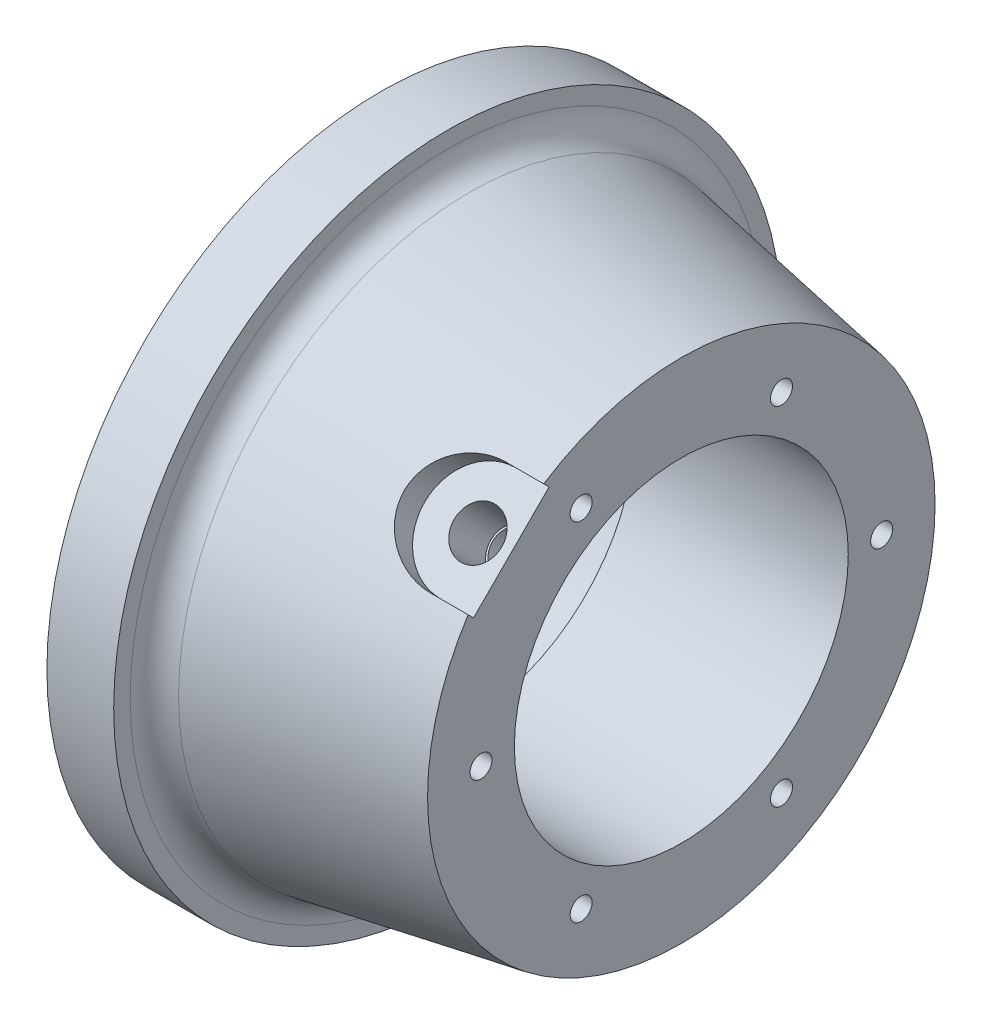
ISO-10303-21;
HEADER;
FILE_DESCRIPTION(('STEP AP214'),'2;1');
FILE_NAME('part.step','',(''),(''),'','','');
FILE_SCHEMA(('AUTOMOTIVE_DESIGN { 1 0 10303 214 1 1 1 1 }'));
ENDSEC;
DATA;
#1=APPLICATION_CONTEXT('core data for automotive mechanical design processes');
#2=APPLICATION_PROTOCOL_DEFINITION('international standard','automotive_design',2000,#1);
#3=PRODUCT_CONTEXT('',#1,'mechanical');
#4=PRODUCT('Part','Part','',(#3));
#5=PRODUCT_RELATED_PRODUCT_CATEGORY('part','',(#4));
#6=PRODUCT_DEFINITION_FORMATION('','',#4);
#7=PRODUCT_DEFINITION_CONTEXT('part definition',#1,'design');
#8=PRODUCT_DEFINITION('design','',#6,#7);
#9=PRODUCT_DEFINITION_SHAPE('','',#8);
#10=(LENGTH_UNIT() NAMED_UNIT(*) SI_UNIT(.MILLI.,.METRE.));
#11=(NAMED_UNIT(*) PLANE_ANGLE_UNIT() SI_UNIT($,.RADIAN.));
#12=(NAMED_UNIT(*) SI_UNIT($,.STERADIAN.) SOLID_ANGLE_UNIT());
#13=UNCERTAINTY_MEASURE_WITH_UNIT(LENGTH_MEASURE(1.E-05),#10,'distance_accuracy_value','');
#14=(GEOMETRIC_REPRESENTATION_CONTEXT(3) GLOBAL_UNCERTAINTY_ASSIGNED_CONTEXT((#13)) GLOBAL_UNIT_ASSIGNED_CONTEXT((#10,
#11,#12)) REPRESENTATION_CONTEXT('',''));
#15=CARTESIAN_POINT('',(0.,0.,0.));
#16=DIRECTION('',(0.,0.,1.));
#17=DIRECTION('',(1.,0.,0.));
#18=AXIS2_PLACEMENT_3D('',#15,#16,#17);
#19=CARTESIAN_POINT('',(9.5,0.,0.));
#20=DIRECTION('',(-1.,0.,0.));
#21=DIRECTION('',(0.,0.,1.));
#22=AXIS2_PLACEMENT_3D('',#19,#20,#21);
#23=PLANE('',#22);
#24=CARTESIAN_POINT('',(9.5,0.,0.));
#25=DIRECTION('',(-1.,0.,0.));
#26=DIRECTION('',(0.,0.,1.));
#27=AXIS2_PLACEMENT_3D('',#24,#25,#26);
#28=CIRCLE('',#27,8.74999999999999);
#29=CARTESIAN_POINT('',(9.5,0.,8.74999999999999));
#30=VERTEX_POINT('',#29);
#31=EDGE_CURVE('E142',#30,#30,#28,.T.);
#32=ORIENTED_EDGE('',*,*,#31,.T.);
#33=EDGE_LOOP('',(#32));
#34=FACE_BOUND('',#33,.T.);
#35=CARTESIAN_POINT('',(9.5,0.,0.));
#36=DIRECTION('',(-1.,0.,0.));
#37=DIRECTION('',(0.,0.,1.));
#38=AXIS2_PLACEMENT_3D('',#35,#36,#37);
#39=CIRCLE('',#38,13.);
#40=CARTESIAN_POINT('',(9.5,0.,13.));
#41=VERTEX_POINT('',#40);
#42=EDGE_CURVE('E210',#41,#41,#39,.T.);
#43=ORIENTED_EDGE('',*,*,#42,.F.);
#44=EDGE_LOOP('',(#43));
#45=FACE_BOUND('',#44,.T.);
#46=ADVANCED_FACE('F43',(#34,#45),#23,.F.);
#47=CARTESIAN_POINT('',(0.,0.,0.));
#48=DIRECTION('',(-1.,0.,0.));
#49=DIRECTION('',(0.,0.,1.));
#50=AXIS2_PLACEMENT_3D('',#47,#48,#49);
#51=CYLINDRICAL_SURFACE('',#50,13.);
#52=CARTESIAN_POINT('',(7.5,0.,0.));
#53=DIRECTION('',(-1.,0.,0.));
#54=DIRECTION('',(0.,0.,1.));
#55=AXIS2_PLACEMENT_3D('',#52,#53,#54);
#56=CIRCLE('',#55,13.);
#57=CARTESIAN_POINT('',(7.5,0.,13.));
#58=VERTEX_POINT('',#57);
#59=EDGE_CURVE('E207',#58,#58,#56,.T.);
#60=ORIENTED_EDGE('',*,*,#59,.F.);
#61=EDGE_LOOP('',(#60));
#62=FACE_BOUND('',#61,.T.);
#63=ORIENTED_EDGE('',*,*,#42,.T.);
#64=EDGE_LOOP('',(#63));
#65=FACE_BOUND('',#64,.T.);
#66=ADVANCED_FACE('F305',(#62,#65),#51,.T.);
#67=CARTESIAN_POINT('',(7.5,13.,0.));
#68=DIRECTION('',(-1.,0.,0.));
#69=DIRECTION('',(0.,0.,1.));
#70=AXIS2_PLACEMENT_3D('',#67,#68,#69);
#71=PLANE('',#70);
#72=CARTESIAN_POINT('',(7.5,18.,0.));
#73=DIRECTION('',(1.,0.,0.));
#74=DIRECTION('',(0.,0.,-1.));
#75=AXIS2_PLACEMENT_3D('',#72,#73,#74);
#76=CIRCLE('',#75,0.999999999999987);
#77=CARTESIAN_POINT('',(7.5,18.,-0.999999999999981));
#78=VERTEX_POINT('',#77);
#79=EDGE_CURVE('E562',#78,#78,#76,.T.);
#80=ORIENTED_EDGE('',*,*,#79,.F.);
#81=EDGE_LOOP('',(#80));
#82=FACE_BOUND('',#81,.T.);
#83=CARTESIAN_POINT('',(7.5,0.,0.));
#84=DIRECTION('',(-1.,0.,0.));
#85=DIRECTION('',(0.,0.,1.));
#86=AXIS2_PLACEMENT_3D('',#83,#84,#85);
#87=CIRCLE('',#86,28.);
#88=CARTESIAN_POINT('',(7.5,0.,28.));
#89=VERTEX_POINT('',#88);
#90=EDGE_CURVE('E202',#89,#89,#87,.T.);
#91=ORIENTED_EDGE('',*,*,#90,.F.);
#92=EDGE_LOOP('',(#91));
#93=FACE_BOUND('',#92,.T.);
#94=ORIENTED_EDGE('',*,*,#59,.T.);
#95=EDGE_LOOP('',(#94));
#96=FACE_BOUND('',#95,.T.);
#97=ADVANCED_FACE('F310',(#82,#93,#96),#71,.F.);
#98=CARTESIAN_POINT('',(0.,0.,0.));
#99=DIRECTION('',(-1.,0.,0.));
#100=DIRECTION('',(0.,0.,1.));
#101=AXIS2_PLACEMENT_3D('',#98,#99,#100);
#102=CYLINDRICAL_SURFACE('',#101,28.);
#103=CARTESIAN_POINT('',(13.,0.,0.));
#104=DIRECTION('',(-1.,0.,0.));
#105=DIRECTION('',(0.,0.,1.));
#106=AXIS2_PLACEMENT_3D('',#103,#104,#105);
#107=CIRCLE('',#106,28.);
#108=CARTESIAN_POINT('',(13.,0.,28.));
#109=VERTEX_POINT('',#108);
#110=EDGE_CURVE('E200',#109,#109,#107,.T.);
#111=ORIENTED_EDGE('',*,*,#110,.F.);
#112=EDGE_LOOP('',(#111));
#113=FACE_BOUND('',#112,.T.);
#114=ORIENTED_EDGE('',*,*,#90,.T.);
#115=EDGE_LOOP('',(#114));
#116=FACE_BOUND('',#115,.T.);
#117=ADVANCED_FACE('F320',(#113,#116),#102,.F.);
#118=CARTESIAN_POINT('',(13.,25.,0.));
#119=DIRECTION('',(1.,0.,0.));
#120=DIRECTION('',(0.,0.,-1.));
#121=AXIS2_PLACEMENT_3D('',#118,#119,#120);
#122=PLANE('',#121);
#123=CARTESIAN_POINT('',(13.,0.,0.));
#124=DIRECTION('',(-1.,0.,0.));
#125=DIRECTION('',(0.,0.,1.));
#126=AXIS2_PLACEMENT_3D('',#123,#124,#125);
#127=CIRCLE('',#126,25.);
#128=CARTESIAN_POINT('',(13.,0.,25.));
#129=VERTEX_POINT('',#128);
#130=EDGE_CURVE('E197',#129,#129,#127,.T.);
#131=ORIENTED_EDGE('',*,*,#130,.F.);
#132=EDGE_LOOP('',(#131));
#133=FACE_BOUND('',#132,.T.);
#134=ORIENTED_EDGE('',*,*,#110,.T.);
#135=EDGE_LOOP('',(#134));
#136=FACE_BOUND('',#135,.T.);
#137=ADVANCED_FACE('F327',(#133,#136),#122,.F.);
#138=CARTESIAN_POINT('',(0.,0.,0.));
#139=DIRECTION('',(-1.,0.,0.));
#140=DIRECTION('',(0.,0.,1.));
#141=AXIS2_PLACEMENT_3D('',#138,#139,#140);
#142=CYLINDRICAL_SURFACE('',#141,25.);
#143=CARTESIAN_POINT('',(40.,16.206796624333,19.0352237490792));
#144=CARTESIAN_POINT('',(39.8878521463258,16.2068008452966,19.035221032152));
#145=CARTESIAN_POINT('',(39.7756275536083,16.2140301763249,19.0290723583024));
#146=CARTESIAN_POINT('',(39.5542823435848,16.242718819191,19.004589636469));
#147=CARTESIAN_POINT('',(39.4451654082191,16.2641943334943,18.9862417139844));
#148=CARTESIAN_POINT('',(39.233273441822,16.3206182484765,18.9377610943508));
#149=CARTESIAN_POINT('',(39.1304948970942,16.3555591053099,18.9076349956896));
#150=CARTESIAN_POINT('',(38.9341442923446,16.4377059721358,18.8362620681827));
#151=CARTESIAN_POINT('',(38.8405702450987,16.4849093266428,18.7950176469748));
#152=CARTESIAN_POINT('',(38.6650375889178,16.5901118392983,18.7022219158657));
#153=CARTESIAN_POINT('',(38.5831038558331,16.6481335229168,18.6506490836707));
#154=CARTESIAN_POINT('',(38.4333912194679,16.7730028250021,18.5384305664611));
#155=CARTESIAN_POINT('',(38.365612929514,16.8398508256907,18.4777844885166));
#156=CARTESIAN_POINT('',(38.2460532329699,16.9803226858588,18.3487801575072));
#157=CARTESIAN_POINT('',(38.1942932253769,17.0539554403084,18.2804117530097));
#158=CARTESIAN_POINT('',(38.1083762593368,17.2056129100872,18.1377427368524));
#159=CARTESIAN_POINT('',(38.0742190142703,17.2836375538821,18.0634422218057));
#160=CARTESIAN_POINT('',(38.0245484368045,17.4415291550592,17.91103202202));
#161=CARTESIAN_POINT('',(38.0089950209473,17.5213917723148,17.8329309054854));
#162=CARTESIAN_POINT('',(37.9968497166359,17.6807709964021,17.674923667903));
#163=CARTESIAN_POINT('',(38.0002575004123,17.7602876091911,17.5950175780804));
#164=CARTESIAN_POINT('',(38.0259050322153,17.916543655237,17.4358789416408));
#165=CARTESIAN_POINT('',(38.0481016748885,17.9932890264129,17.3566452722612));
#166=CARTESIAN_POINT('',(38.1106298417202,18.1421257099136,17.2010138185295));
#167=CARTESIAN_POINT('',(38.1509615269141,18.2142169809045,17.1246160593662));
#168=CARTESIAN_POINT('',(38.2486630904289,18.3519732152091,16.9769049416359));
#169=CARTESIAN_POINT('',(38.3060523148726,18.417630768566,16.9055974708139));
#170=CARTESIAN_POINT('',(38.4362258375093,18.540820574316,16.770401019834));
#171=CARTESIAN_POINT('',(38.5090104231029,18.5983526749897,16.7065121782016));
#172=CARTESIAN_POINT('',(38.6681516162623,18.7040931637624,16.5880449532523));
#173=CARTESIAN_POINT('',(38.7545456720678,18.7522749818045,16.5334931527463));
#174=CARTESIAN_POINT('',(38.9383227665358,18.8380194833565,16.4357313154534));
#175=CARTESIAN_POINT('',(39.0357058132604,18.8755821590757,16.3925212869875));
#176=CARTESIAN_POINT('',(39.2387224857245,18.9392599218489,16.3189097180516));
#177=CARTESIAN_POINT('',(39.3443570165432,18.9653737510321,16.2885095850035));
#178=CARTESIAN_POINT('',(39.5608657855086,19.0055763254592,16.2415834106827));
#179=CARTESIAN_POINT('',(39.6717399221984,19.0196653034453,16.2250571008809));
#180=CARTESIAN_POINT('',(39.8952518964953,19.0354909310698,16.2064874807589));
#181=CARTESIAN_POINT('',(40.0078839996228,19.0372616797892,16.204404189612));
#182=CARTESIAN_POINT('',(40.2320034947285,19.0285030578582,16.2146882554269));
#183=CARTESIAN_POINT('',(40.3434908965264,19.0179737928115,16.2270554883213));
#184=CARTESIAN_POINT('',(40.5620062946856,18.9848647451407,16.2657785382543));
#185=CARTESIAN_POINT('',(40.6690399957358,18.9623009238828,16.2921158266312));
#186=CARTESIAN_POINT('',(40.8757862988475,18.9056206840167,16.3578537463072));
#187=CARTESIAN_POINT('',(40.9754987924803,18.8715040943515,16.3972545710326));
#188=CARTESIAN_POINT('',(41.165012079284,18.7923772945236,16.4878794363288));
#189=CARTESIAN_POINT('',(41.2547906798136,18.7473433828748,16.5391291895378));
#190=CARTESIAN_POINT('',(41.4216635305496,18.6474306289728,16.6516959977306));
#191=CARTESIAN_POINT('',(41.4987575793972,18.5925516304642,16.7130132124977));
#192=CARTESIAN_POINT('',(41.6382513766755,18.4740839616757,16.8438717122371));
#193=CARTESIAN_POINT('',(41.7006171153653,18.410475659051,16.9134314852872));
#194=CARTESIAN_POINT('',(41.8086507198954,18.276191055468,17.0584463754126));
#195=CARTESIAN_POINT('',(41.854318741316,18.2055148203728,17.1339014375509));
#196=CARTESIAN_POINT('',(41.9276020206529,18.0589831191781,17.2882743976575));
#197=CARTESIAN_POINT('',(41.9552383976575,17.983133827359,17.367188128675));
#198=CARTESIAN_POINT('',(41.9917429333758,17.8282129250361,17.5261843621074));
#199=CARTESIAN_POINT('',(42.0006114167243,17.749141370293,17.6062668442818));
#200=CARTESIAN_POINT('',(41.9993247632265,17.5902151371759,17.765047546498));
#201=CARTESIAN_POINT('',(41.9892226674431,17.5103632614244,17.8437490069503));
#202=CARTESIAN_POINT('',(41.9503921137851,17.3519757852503,17.9978094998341));
#203=CARTESIAN_POINT('',(41.9216636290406,17.2734401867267,18.0731685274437));
#204=CARTESIAN_POINT('',(41.8464090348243,17.1200448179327,18.218541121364));
#205=CARTESIAN_POINT('',(41.7998837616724,17.0451848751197,18.2885549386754));
#206=CARTESIAN_POINT('',(41.6903624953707,16.9014468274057,18.4214736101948));
#207=CARTESIAN_POINT('',(41.6273667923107,16.8325686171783,18.4843785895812));
#208=CARTESIAN_POINT('',(41.4864939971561,16.7027980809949,18.6017263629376));
#209=CARTESIAN_POINT('',(41.4085777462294,16.6419274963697,18.6561461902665));
#210=CARTESIAN_POINT('',(41.2401443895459,16.5303601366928,18.7550731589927));
#211=CARTESIAN_POINT('',(41.1496242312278,16.4796658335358,18.7995778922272));
#212=CARTESIAN_POINT('',(40.958390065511,16.3900876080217,18.877727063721));
#213=CARTESIAN_POINT('',(40.857658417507,16.3512246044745,18.9113522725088));
#214=CARTESIAN_POINT('',(40.6490585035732,16.2868006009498,18.9668645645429));
#215=CARTESIAN_POINT('',(40.5411986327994,16.2612242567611,18.9887651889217));
#216=CARTESIAN_POINT('',(40.3605817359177,16.2307980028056,19.0147686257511));
#217=CARTESIAN_POINT('',(40.2889874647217,16.2218115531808,19.0224313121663));
#218=CARTESIAN_POINT('',(40.144939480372,16.2098095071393,19.0326597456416));
#219=CARTESIAN_POINT('',(40.0724857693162,16.2067938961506,19.035225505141));
#220=CARTESIAN_POINT('',(40.,16.206796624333,19.0352237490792));
#221=B_SPLINE_CURVE_WITH_KNOTS('',3,(#143,#144,#145,#146,#147,#148,#149,#150,#151,#152,#153,
#154,#155,#156,#157,#158,#159,#160,#161,#162,#163,#164,#165,#166,#167,#168,#169,#170,#171,#172,
#173,#174,#175,#176,#177,#178,#179,#180,#181,#182,#183,#184,#185,#186,#187,#188,#189,#190,#191,
#192,#193,#194,#195,#196,#197,#198,#199,#200,#201,#202,#203,#204,#205,#206,#207,#208,#209,#210,
#211,#212,#213,#214,#215,#216,#217,#218,#219,#220),.UNSPECIFIED.,.T.,.F.,(4,2,2,2,2,2,2,2,2,2,2,
2,2,2,2,2,2,2,2,2,2,2,2,2,2,2,2,2,2,2,2,2,2,2,2,2,2,2,4),(0.,0.336178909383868,
0.672740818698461,1.00911444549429,1.34541529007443,1.68242434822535,2.01944800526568,
2.35691997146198,2.69438644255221,3.03112449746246,3.36785673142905,3.70381852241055,
4.03978329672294,4.37613057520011,4.71248413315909,5.04977992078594,5.38707595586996,
5.72440903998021,6.06173559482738,6.3981279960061,6.7345175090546,7.07046197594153,
7.40641141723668,7.74309684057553,8.07978760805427,8.41724840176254,8.75470605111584,
9.09176774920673,9.42882361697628,9.76493849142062,10.1010538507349,10.4371534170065,
10.7732470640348,11.1102351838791,11.4473050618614,11.7849674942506,12.122239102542,
12.339525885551,12.5568121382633),.UNSPECIFIED.);
#222=CARTESIAN_POINT('',(40.,16.206796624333,19.0352237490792));
#223=VERTEX_POINT('',#222);
#224=EDGE_CURVE('E555',#223,#223,#221,.T.);
#225=ORIENTED_EDGE('',*,*,#224,.F.);
#226=EDGE_LOOP('',(#225));
#227=FACE_BOUND('',#226,.T.);
#228=CARTESIAN_POINT('',(45.,0.,0.));
#229=DIRECTION('',(-1.,0.,0.));
#230=DIRECTION('',(0.,0.,1.));
#231=AXIS2_PLACEMENT_3D('',#228,#229,#230);
#232=CIRCLE('',#231,25.);
#233=CARTESIAN_POINT('',(45.,0.,25.));
#234=VERTEX_POINT('',#233);
#235=EDGE_CURVE('E194',#234,#234,#232,.T.);
#236=ORIENTED_EDGE('',*,*,#235,.F.);
#237=EDGE_LOOP('',(#236));
#238=FACE_BOUND('',#237,.T.);
#239=ORIENTED_EDGE('',*,*,#130,.T.);
#240=EDGE_LOOP('',(#239));
#241=FACE_BOUND('',#240,.T.);
#242=ADVANCED_FACE('F331',(#227,#238,#241),#142,.F.);
#243=CARTESIAN_POINT('',(45.,38.,0.));
#244=DIRECTION('',(-1.,0.,0.));
#245=DIRECTION('',(0.,0.,1.));
#246=AXIS2_PLACEMENT_3D('',#243,#244,#245);
#247=PLANE('',#246);
#248=CARTESIAN_POINT('',(45.,0.,0.));
#249=DIRECTION('',(-1.,0.,0.));
#250=DIRECTION('',(0.,0.,1.));
#251=AXIS2_PLACEMENT_3D('',#248,#249,#250);
#252=CIRCLE('',#251,38.);
#253=CARTESIAN_POINT('',(45.,31.9247053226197,20.6109968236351));
#254=VERTEX_POINT('',#253);
#255=CARTESIAN_POINT('',(45.,20.610996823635,31.9247053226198));
#256=VERTEX_POINT('',#255);
#257=EDGE_CURVE('E192',#254,#256,#252,.T.);
#258=ORIENTED_EDGE('',*,*,#257,.F.);
#259=DIRECTION('',(0.,-0.707106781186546,-0.707106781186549));
#260=VECTOR('',#259,1.);
#261=CARTESIAN_POINT('',(45.,55.6568542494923,44.3431457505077));
#262=LINE('',#261,#260);
#263=CARTESIAN_POINT('',(45.,31.1126983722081,19.7989898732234));
#264=VERTEX_POINT('',#263);
#265=EDGE_CURVE('E125',#254,#264,#262,.T.);
#266=ORIENTED_EDGE('',*,*,#265,.T.);
#267=DIRECTION('',(0.,-0.707106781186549,0.707106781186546));
#268=VECTOR('',#267,1.);
#269=CARTESIAN_POINT('',(45.,19.7989898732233,31.1126983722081));
#270=LINE('',#269,#268);
#271=CARTESIAN_POINT('',(45.,19.7989898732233,31.1126983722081));
#272=VERTEX_POINT('',#271);
#273=EDGE_CURVE('E117',#264,#272,#270,.T.);
#274=ORIENTED_EDGE('',*,*,#273,.T.);
#275=DIRECTION('',(0.,-0.707106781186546,-0.707106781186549));
#276=VECTOR('',#275,1.);
#277=CARTESIAN_POINT('',(45.,44.3431457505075,55.6568542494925));
#278=LINE('',#277,#276);
#279=EDGE_CURVE('E101',#256,#272,#278,.T.);
#280=ORIENTED_EDGE('',*,*,#279,.F.);
#281=EDGE_LOOP('',(#258,#266,#274,#280));
#282=FACE_BOUND('',#281,.T.);
#283=CARTESIAN_POINT('',(45.,-25.980762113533,-15.0000000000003));
#284=DIRECTION('',(1.,0.,0.));
#285=DIRECTION('',(0.,0.,-1.));
#286=AXIS2_PLACEMENT_3D('',#283,#284,#285);
#287=CIRCLE('',#286,1.65);
#288=CARTESIAN_POINT('',(45.,-25.980762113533,-16.6500000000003));
#289=VERTEX_POINT('',#288);
#290=EDGE_CURVE('E146',#289,#289,#287,.T.);
#291=ORIENTED_EDGE('',*,*,#290,.F.);
#292=EDGE_LOOP('',(#291));
#293=FACE_BOUND('',#292,.T.);
#294=CARTESIAN_POINT('',(45.,-25.9807621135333,14.9999999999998));
#295=DIRECTION('',(1.,0.,0.));
#296=DIRECTION('',(0.,0.,-1.));
#297=AXIS2_PLACEMENT_3D('',#294,#295,#296);
#298=CIRCLE('',#297,1.65);
#299=CARTESIAN_POINT('',(45.,-25.9807621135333,13.3499999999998));
#300=VERTEX_POINT('',#299);
#301=EDGE_CURVE('E152',#300,#300,#298,.T.);
#302=ORIENTED_EDGE('',*,*,#301,.F.);
#303=EDGE_LOOP('',(#302));
#304=FACE_BOUND('',#303,.T.);
#305=CARTESIAN_POINT('',(45.,-2.09489001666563E-13,30.));
#306=DIRECTION('',(1.,0.,0.));
#307=DIRECTION('',(0.,0.,-1.));
#308=AXIS2_PLACEMENT_3D('',#305,#306,#307);
#309=CIRCLE('',#308,1.65);
#310=CARTESIAN_POINT('',(45.,-2.09489001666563E-13,28.35));
#311=VERTEX_POINT('',#310);
#312=EDGE_CURVE('E158',#311,#311,#309,.T.);
#313=ORIENTED_EDGE('',*,*,#312,.F.);
#314=EDGE_LOOP('',(#313));
#315=FACE_BOUND('',#314,.T.);
#316=CARTESIAN_POINT('',(45.,25.9807621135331,15.0000000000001));
#317=DIRECTION('',(1.,0.,0.));
#318=DIRECTION('',(0.,0.,-1.));
#319=AXIS2_PLACEMENT_3D('',#316,#317,#318);
#320=CIRCLE('',#319,1.65);
#321=CARTESIAN_POINT('',(45.,25.9807621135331,13.3500000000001));
#322=VERTEX_POINT('',#321);
#323=EDGE_CURVE('E164',#322,#322,#320,.T.);
#324=ORIENTED_EDGE('',*,*,#323,.F.);
#325=EDGE_LOOP('',(#324));
#326=FACE_BOUND('',#325,.T.);
#327=CARTESIAN_POINT('',(45.,25.9807621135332,-14.9999999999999));
#328=DIRECTION('',(1.,0.,0.));
#329=DIRECTION('',(0.,0.,-1.));
#330=AXIS2_PLACEMENT_3D('',#327,#328,#329);
#331=CIRCLE('',#330,1.65);
#332=CARTESIAN_POINT('',(45.,25.9807621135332,-16.6499999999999));
#333=VERTEX_POINT('',#332);
#334=EDGE_CURVE('E170',#333,#333,#331,.T.);
#335=ORIENTED_EDGE('',*,*,#334,.F.);
#336=EDGE_LOOP('',(#335));
#337=FACE_BOUND('',#336,.T.);
#338=CARTESIAN_POINT('',(45.,0.,-30.));
#339=DIRECTION('',(1.,0.,0.));
#340=DIRECTION('',(0.,0.,-1.));
#341=AXIS2_PLACEMENT_3D('',#338,#339,#340);
#342=CIRCLE('',#341,1.65);
#343=CARTESIAN_POINT('',(45.,0.,-31.65));
#344=VERTEX_POINT('',#343);
#345=EDGE_CURVE('E176',#344,#344,#342,.T.);
#346=ORIENTED_EDGE('',*,*,#345,.F.);
#347=EDGE_LOOP('',(#346));
#348=FACE_BOUND('',#347,.T.);
#349=ORIENTED_EDGE('',*,*,#235,.T.);
#350=EDGE_LOOP('',(#349));
#351=FACE_BOUND('',#350,.T.);
#352=ADVANCED_FACE('F123',(#282,#293,#304,#315,#326,#337,#348,#351),#247,.F.);
#353=CARTESIAN_POINT('',(45.,0.,0.));
#354=DIRECTION('',(-1.,0.,0.));
#355=DIRECTION('',(0.,0.,1.));
#356=AXIS2_PLACEMENT_3D('',#353,#354,#355);
#357=CONICAL_SURFACE('',#356,38.,0.17453292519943);
#358=CARTESIAN_POINT('',(13.3054072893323,0.,0.));
#359=DIRECTION('',(-1.,0.,0.));
#360=DIRECTION('',(0.,0.,1.));
#361=AXIS2_PLACEMENT_3D('',#358,#359,#360);
#362=CIRCLE('',#361,43.5886118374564);
#363=CARTESIAN_POINT('',(13.3054072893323,0.,43.5886118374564));
#364=VERTEX_POINT('',#363);
#365=EDGE_CURVE('E188',#364,#364,#362,.T.);
#366=ORIENTED_EDGE('',*,*,#365,.F.);
#367=EDGE_LOOP('',(#366));
#368=FACE_BOUND('',#367,.T.);
#369=CARTESIAN_POINT('',(40.0002,21.2483384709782,32.5620469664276));
#370=CARTESIAN_POINT('',(39.7698311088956,21.2776537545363,32.5914024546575));
#371=CARTESIAN_POINT('',(39.5398570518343,21.3154920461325,32.615146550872));
#372=CARTESIAN_POINT('',(39.0823707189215,21.4075767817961,32.6512913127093));
#373=CARTESIAN_POINT('',(38.8548578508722,21.461819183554,32.6636947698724));
#374=CARTESIAN_POINT('',(38.4041874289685,21.5859966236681,32.6770422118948));
#375=CARTESIAN_POINT('',(38.1810238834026,21.6559081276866,32.6780032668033));
#376=CARTESIAN_POINT('',(37.7401880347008,21.8106774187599,32.6684126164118));
#377=CARTESIAN_POINT('',(37.5225159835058,21.8955358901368,32.6578603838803));
#378=CARTESIAN_POINT('',(37.0942390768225,22.0792437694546,32.6251652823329));
#379=CARTESIAN_POINT('',(36.88362943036,22.17808344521,32.6030304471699));
#380=CARTESIAN_POINT('',(36.4705811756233,22.388861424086,32.5470863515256));
#381=CARTESIAN_POINT('',(36.2681455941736,22.5008045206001,32.5132728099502));
#382=CARTESIAN_POINT('',(35.8727868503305,22.7367260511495,32.4339029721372));
#383=CARTESIAN_POINT('',(35.6798646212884,22.8607056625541,32.3883455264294));
#384=CARTESIAN_POINT('',(35.3047835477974,23.1195840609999,32.2854420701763));
#385=CARTESIAN_POINT('',(35.1226249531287,23.2544831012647,32.2280957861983));
#386=CARTESIAN_POINT('',(34.7670001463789,23.5366278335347,32.1004230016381));
#387=CARTESIAN_POINT('',(34.5937581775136,23.6840562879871,32.0298752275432));
#388=CARTESIAN_POINT('',(34.2609305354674,23.9877268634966,31.8765644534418));
#389=CARTESIAN_POINT('',(34.1013450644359,24.1439691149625,31.793801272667));
#390=CARTESIAN_POINT('',(33.7970504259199,24.4638919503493,31.6161656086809));
#391=CARTESIAN_POINT('',(33.652341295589,24.6275725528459,31.5212930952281));
#392=CARTESIAN_POINT('',(33.3789996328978,24.9609082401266,31.3196502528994));
#393=CARTESIAN_POINT('',(33.2503658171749,25.130562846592,31.2128808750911));
#394=CARTESIAN_POINT('',(33.0130372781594,25.4704153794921,30.9903328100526));
#395=CARTESIAN_POINT('',(32.9039558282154,25.6405133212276,30.874814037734));
#396=CARTESIAN_POINT('',(32.7032724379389,25.983391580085,30.633231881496));
#397=CARTESIAN_POINT('',(32.6116630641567,26.1561707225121,30.5071730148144));
#398=CARTESIAN_POINT('',(32.4467878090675,26.5028936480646,30.2451119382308));
#399=CARTESIAN_POINT('',(32.3735187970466,26.6768372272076,30.1091114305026));
#400=CARTESIAN_POINT('',(32.2460803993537,27.024318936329,29.8279522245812));
#401=CARTESIAN_POINT('',(32.1919099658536,27.1978570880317,29.6827940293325));
#402=CARTESIAN_POINT('',(32.105844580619,27.5328912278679,29.3929901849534));
#403=CARTESIAN_POINT('',(32.072837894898,27.6945008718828,29.2488051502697));
#404=CARTESIAN_POINT('',(32.0246347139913,28.0146252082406,28.9541623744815));
#405=CARTESIAN_POINT('',(32.0094374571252,28.1731400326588,28.803704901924));
#406=CARTESIAN_POINT('',(31.9970123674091,28.4857870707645,28.4976438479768));
#407=CARTESIAN_POINT('',(31.999781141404,28.6399201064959,28.3420412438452));
#408=CARTESIAN_POINT('',(32.0232510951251,28.9426606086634,28.0268664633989));
#409=CARTESIAN_POINT('',(32.0439520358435,29.0912681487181,27.8672943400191));
#410=CARTESIAN_POINT('',(32.1020165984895,29.3767235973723,27.5511894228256));
#411=CARTESIAN_POINT('',(32.1387615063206,29.5138017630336,27.3947503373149));
#412=CARTESIAN_POINT('',(32.2283954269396,29.7810425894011,27.080505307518));
#413=CARTESIAN_POINT('',(32.2812897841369,29.9112029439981,26.92269892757));
#414=CARTESIAN_POINT('',(32.4027181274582,30.1638063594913,26.60702407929));
#415=CARTESIAN_POINT('',(32.471247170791,30.2862518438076,26.4491556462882));
#416=CARTESIAN_POINT('',(32.6233899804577,30.5229319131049,26.1344389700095));
#417=CARTESIAN_POINT('',(32.7070094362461,30.6371633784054,25.9775911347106));
#418=CARTESIAN_POINT('',(32.8905224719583,30.8591866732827,25.6629046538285));
#419=CARTESIAN_POINT('',(32.9907178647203,30.9667955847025,25.5051130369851));
#420=CARTESIAN_POINT('',(33.2053412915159,31.1725903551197,25.1930127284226));
#421=CARTESIAN_POINT('',(33.3197742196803,31.2707729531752,25.0387052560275));
#422=CARTESIAN_POINT('',(33.5619983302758,31.4574096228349,24.7347786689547));
#423=CARTESIAN_POINT('',(33.6897891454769,31.5458639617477,24.5851594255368));
#424=CARTESIAN_POINT('',(33.9578580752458,31.7128780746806,24.2916925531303));
#425=CARTESIAN_POINT('',(34.098136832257,31.791437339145,24.1478452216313));
#426=CARTESIAN_POINT('',(34.3984916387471,31.9426919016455,23.8590730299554));
#427=CARTESIAN_POINT('',(34.5592371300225,32.0148098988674,23.7145415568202));
#428=CARTESIAN_POINT('',(34.8925226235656,32.1478192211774,23.4342915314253));
#429=CARTESIAN_POINT('',(35.0650593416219,32.2087136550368,23.2985705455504));
#430=CARTESIAN_POINT('',(35.4210295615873,32.3193494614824,23.0368844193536));
#431=CARTESIAN_POINT('',(35.60447262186,32.3690808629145,22.9109280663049));
#432=CARTESIAN_POINT('',(35.980920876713,32.4573373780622,22.6700025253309));
#433=CARTESIAN_POINT('',(36.1739228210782,32.4958662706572,22.5550296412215));
#434=CARTESIAN_POINT('',(36.5767809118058,32.5631970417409,22.3323806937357));
#435=CARTESIAN_POINT('',(36.7870047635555,32.5915155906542,22.2252228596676));
#436=CARTESIAN_POINT('',(37.2151942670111,32.6361232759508,22.0249812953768));
#437=CARTESIAN_POINT('',(37.4331570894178,32.6524167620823,21.9318924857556));
#438=CARTESIAN_POINT('',(37.8751830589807,32.6730675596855,21.760823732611));
#439=CARTESIAN_POINT('',(38.099238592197,32.6774391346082,21.68282583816));
#440=CARTESIAN_POINT('',(38.5520829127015,32.6743832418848,21.5427066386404));
#441=CARTESIAN_POINT('',(38.7808692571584,32.6669617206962,21.4805773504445));
#442=CARTESIAN_POINT('',(39.1749795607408,32.644280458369,21.3884748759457));
#443=CARTESIAN_POINT('',(39.3395268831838,32.6319073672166,21.3543981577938));
#444=CARTESIAN_POINT('',(39.6693797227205,32.6013311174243,21.2948754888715));
#445=CARTESIAN_POINT('',(39.8346837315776,32.5831367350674,21.2694166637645));
#446=CARTESIAN_POINT('',(40.0002,32.5620469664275,21.2483384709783));
#447=B_SPLINE_CURVE_WITH_KNOTS('',3,(#369,#370,#371,#372,#373,#374,#375,#376,#377,#378,#379,
#380,#381,#382,#383,#384,#385,#386,#387,#388,#389,#390,#391,#392,#393,#394,#395,#396,#397,#398,
#399,#400,#401,#402,#403,#404,#405,#406,#407,#408,#409,#410,#411,#412,#413,#414,#415,#416,#417,
#418,#419,#420,#421,#422,#423,#424,#425,#426,#427,#428,#429,#430,#431,#432,#433,#434,#435,#436,
#437,#438,#439,#440,#441,#442,#443,#444,#445,#446),.UNSPECIFIED.,.F.,.F.,(4,2,2,2,2,2,2,2,2,2,2,
2,2,2,2,2,2,2,2,2,2,2,2,2,2,2,2,2,2,2,2,2,2,2,2,2,2,2,4),(0.,0.701967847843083,1.40376285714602,
2.10451078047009,2.80529079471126,3.50558538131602,4.20613694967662,4.90675711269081,
5.60739352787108,6.32104117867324,7.03469939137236,7.74835938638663,8.46196237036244,
9.15934667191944,9.85643360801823,10.5534014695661,11.2503310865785,11.9067522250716,
12.5631452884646,13.2194143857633,13.8756747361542,14.5085980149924,15.1417309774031,
15.7746640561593,16.4078362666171,17.0541531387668,17.7006927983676,18.3472146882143,
18.9937698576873,19.6766447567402,20.3593302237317,21.04262308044,21.7256851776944,
22.4377952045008,23.1496475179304,23.8606477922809,24.5712896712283,25.0764651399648,
25.5808825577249),.UNSPECIFIED.);
#448=CARTESIAN_POINT('',(40.,21.2483639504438,32.5620724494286));
#449=VERTEX_POINT('',#448);
#450=CARTESIAN_POINT('',(40.,32.5620724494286,21.2483639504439));
#451=VERTEX_POINT('',#450);
#452=EDGE_CURVE('E55',#449,#451,#447,.T.);
#453=ORIENTED_EDGE('',*,*,#452,.T.);
#454=CARTESIAN_POINT('',(39.9998,32.5620979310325,21.2483894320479));
#455=CARTESIAN_POINT('',(40.8332136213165,32.4559150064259,21.1422065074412));
#456=CARTESIAN_POINT('',(41.6666204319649,32.3497053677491,21.0359968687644));
#457=CARTESIAN_POINT('',(43.3334204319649,32.1372326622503,20.8235241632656));
#458=CARTESIAN_POINT('',(44.1668136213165,32.0309695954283,20.7172610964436));
#459=CARTESIAN_POINT('',(45.0002,31.9246798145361,20.6109713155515));
#460=B_SPLINE_CURVE_WITH_KNOTS('',3,(#454,#455,#456,#457,#458,#459),.UNSPECIFIED.,.F.,.F.,(4,2,
4),(0.,2.54050211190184,5.08100422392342),.UNSPECIFIED.);
#461=EDGE_CURVE('E12',#451,#254,#460,.T.);
#462=ORIENTED_EDGE('',*,*,#461,.T.);
#463=ORIENTED_EDGE('',*,*,#257,.T.);
#464=CARTESIAN_POINT('',(45.0002,20.6109713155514,31.9246798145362));
#465=CARTESIAN_POINT('',(44.1668136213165,20.7172610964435,32.0309695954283));
#466=CARTESIAN_POINT('',(43.3334204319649,20.8235241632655,32.1372326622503));
#467=CARTESIAN_POINT('',(41.6666204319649,21.0359968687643,32.3497053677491));
#468=CARTESIAN_POINT('',(40.8332136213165,21.1422065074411,32.4559150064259));
#469=CARTESIAN_POINT('',(39.9998,21.2483894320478,32.5620979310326));
#470=B_SPLINE_CURVE_WITH_KNOTS('',3,(#464,#465,#466,#467,#468,#469),.UNSPECIFIED.,.F.,.F.,(4,2,
4),(0.,2.54050211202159,5.08100422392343),.UNSPECIFIED.);
#471=EDGE_CURVE('E106',#256,#449,#470,.T.);
#472=ORIENTED_EDGE('',*,*,#471,.T.);
#473=EDGE_LOOP('',(#453,#462,#463,#472));
#474=FACE_BOUND('',#473,.T.);
#475=ADVANCED_FACE('F223',(#368,#474),#357,.T.);
#476=CARTESIAN_POINT('',(14.,0.,0.));
#477=DIRECTION('',(-1.,0.,0.));
#478=DIRECTION('',(0.,0.,1.));
#479=AXIS2_PLACEMENT_3D('',#476,#477,#478);
#480=TOROIDAL_SURFACE('',#479,47.5278428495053,4.);
#481=CARTESIAN_POINT('',(10.,0.,0.));
#482=DIRECTION('',(-1.,0.,0.));
#483=DIRECTION('',(0.,0.,1.));
#484=AXIS2_PLACEMENT_3D('',#481,#482,#483);
#485=CIRCLE('',#484,47.5278428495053);
#486=CARTESIAN_POINT('',(10.,0.,47.5278428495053));
#487=VERTEX_POINT('',#486);
#488=EDGE_CURVE('E185',#487,#487,#485,.T.);
#489=ORIENTED_EDGE('',*,*,#488,.F.);
#490=EDGE_LOOP('',(#489));
#491=FACE_BOUND('',#490,.T.);
#492=ORIENTED_EDGE('',*,*,#365,.T.);
#493=EDGE_LOOP('',(#492));
#494=FACE_BOUND('',#493,.T.);
#495=ADVANCED_FACE('F294',(#491,#494),#480,.F.);
#496=CARTESIAN_POINT('',(10.,50.,0.));
#497=DIRECTION('',(-1.,0.,0.));
#498=DIRECTION('',(0.,0.,1.));
#499=AXIS2_PLACEMENT_3D('',#496,#497,#498);
#500=PLANE('',#499);
#501=CARTESIAN_POINT('',(10.,0.,0.));
#502=DIRECTION('',(-1.,0.,0.));
#503=DIRECTION('',(0.,0.,1.));
#504=AXIS2_PLACEMENT_3D('',#501,#502,#503);
#505=CIRCLE('',#504,50.);
#506=CARTESIAN_POINT('',(10.,0.,50.));
#507=VERTEX_POINT('',#506);
#508=EDGE_CURVE('E182',#507,#507,#505,.T.);
#509=ORIENTED_EDGE('',*,*,#508,.F.);
#510=EDGE_LOOP('',(#509));
#511=FACE_BOUND('',#510,.T.);
#512=ORIENTED_EDGE('',*,*,#488,.T.);
#513=EDGE_LOOP('',(#512));
#514=FACE_BOUND('',#513,.T.);
#515=ADVANCED_FACE('F291',(#511,#514),#500,.F.);
#516=CARTESIAN_POINT('',(0.,0.,0.));
#517=DIRECTION('',(-1.,0.,0.));
#518=DIRECTION('',(0.,0.,1.));
#519=AXIS2_PLACEMENT_3D('',#516,#517,#518);
#520=CYLINDRICAL_SURFACE('',#519,50.);
#521=CARTESIAN_POINT('',(0.,0.,0.));
#522=DIRECTION('',(-1.,0.,0.));
#523=DIRECTION('',(0.,0.,1.));
#524=AXIS2_PLACEMENT_3D('',#521,#522,#523);
#525=CIRCLE('',#524,50.);
#526=CARTESIAN_POINT('',(0.,0.,50.));
#527=VERTEX_POINT('',#526);
#528=EDGE_CURVE('E179',#527,#527,#525,.T.);
#529=ORIENTED_EDGE('',*,*,#528,.F.);
#530=EDGE_LOOP('',(#529));
#531=FACE_BOUND('',#530,.T.);
#532=ORIENTED_EDGE('',*,*,#508,.T.);
#533=EDGE_LOOP('',(#532));
#534=FACE_BOUND('',#533,.T.);
#535=ADVANCED_FACE('F287',(#531,#534),#520,.T.);
#536=CARTESIAN_POINT('',(0.,0.,0.));
#537=DIRECTION('',(1.,0.,0.));
#538=DIRECTION('',(0.,0.,-1.));
#539=AXIS2_PLACEMENT_3D('',#536,#537,#538);
#540=PLANE('',#539);
#541=CARTESIAN_POINT('',(0.,18.,0.));
#542=DIRECTION('',(1.,0.,0.));
#543=DIRECTION('',(0.,0.,-1.));
#544=AXIS2_PLACEMENT_3D('',#541,#542,#543);
#545=CIRCLE('',#544,0.999999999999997);
#546=CARTESIAN_POINT('',(0.,18.,-0.999999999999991));
#547=VERTEX_POINT('',#546);
#548=EDGE_CURVE('E583',#547,#547,#545,.T.);
#549=ORIENTED_EDGE('',*,*,#548,.T.);
#550=EDGE_LOOP('',(#549));
#551=FACE_BOUND('',#550,.T.);
#552=CARTESIAN_POINT('',(0.,0.,0.));
#553=DIRECTION('',(-1.,0.,0.));
#554=DIRECTION('',(0.,0.,1.));
#555=AXIS2_PLACEMENT_3D('',#552,#553,#554);
#556=CIRCLE('',#555,8.75);
#557=CARTESIAN_POINT('',(0.,0.,8.75));
#558=VERTEX_POINT('',#557);
#559=EDGE_CURVE('E136',#558,#558,#556,.T.);
#560=ORIENTED_EDGE('',*,*,#559,.F.);
#561=EDGE_LOOP('',(#560));
#562=FACE_BOUND('',#561,.T.);
#563=ORIENTED_EDGE('',*,*,#528,.T.);
#564=EDGE_LOOP('',(#563));
#565=FACE_BOUND('',#564,.T.);
#566=ADVANCED_FACE('F283',(#551,#562,#565),#540,.F.);
#567=CARTESIAN_POINT('',(45.,0.,-30.));
#568=DIRECTION('',(1.,0.,0.));
#569=DIRECTION('',(0.,0.,-1.));
#570=AXIS2_PLACEMENT_3D('',#567,#568,#569);
#571=CYLINDRICAL_SURFACE('',#570,1.65);
#572=CARTESIAN_POINT('',(26.5,0.,-30.));
#573=DIRECTION('',(1.,0.,0.));
#574=DIRECTION('',(0.,0.,-1.));
#575=AXIS2_PLACEMENT_3D('',#572,#573,#574);
#576=CIRCLE('',#575,1.65);
#577=CARTESIAN_POINT('',(26.5,0.,-31.65));
#578=VERTEX_POINT('',#577);
#579=EDGE_CURVE('E173',#578,#578,#576,.T.);
#580=ORIENTED_EDGE('',*,*,#579,.F.);
#581=EDGE_LOOP('',(#580));
#582=FACE_BOUND('',#581,.T.);
#583=ORIENTED_EDGE('',*,*,#345,.T.);
#584=EDGE_LOOP('',(#583));
#585=FACE_BOUND('',#584,.T.);
#586=ADVANCED_FACE('F280',(#582,#585),#571,.F.);
#587=CARTESIAN_POINT('',(26.5,0.,-30.));
#588=DIRECTION('',(1.,0.,0.));
#589=DIRECTION('',(0.,0.,-1.));
#590=AXIS2_PLACEMENT_3D('',#587,#588,#589);
#591=CONICAL_SURFACE('',#590,1.65,1.02974425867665);
#592=CARTESIAN_POINT('',(25.5085799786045,0.,-30.));
#593=VERTEX_POINT('',#592);
#594=VERTEX_LOOP('',#593);
#595=FACE_BOUND('',#594,.T.);
#596=ORIENTED_EDGE('',*,*,#579,.T.);
#597=EDGE_LOOP('',(#596));
#598=FACE_BOUND('',#597,.T.);
#599=ADVANCED_FACE('F276',(#595,#598),#591,.F.);
#600=CARTESIAN_POINT('',(45.,25.9807621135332,-14.9999999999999));
#601=DIRECTION('',(1.,0.,0.));
#602=DIRECTION('',(0.,0.,-1.));
#603=AXIS2_PLACEMENT_3D('',#600,#601,#602);
#604=CYLINDRICAL_SURFACE('',#603,1.65);
#605=CARTESIAN_POINT('',(26.5,25.9807621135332,-14.9999999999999));
#606=DIRECTION('',(1.,0.,0.));
#607=DIRECTION('',(0.,0.,-1.));
#608=AXIS2_PLACEMENT_3D('',#605,#606,#607);
#609=CIRCLE('',#608,1.65);
#610=CARTESIAN_POINT('',(26.5,25.9807621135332,-16.6499999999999));
#611=VERTEX_POINT('',#610);
#612=EDGE_CURVE('E167',#611,#611,#609,.T.);
#613=ORIENTED_EDGE('',*,*,#612,.F.);
#614=EDGE_LOOP('',(#613));
#615=FACE_BOUND('',#614,.T.);
#616=ORIENTED_EDGE('',*,*,#334,.T.);
#617=EDGE_LOOP('',(#616));
#618=FACE_BOUND('',#617,.T.);
#619=ADVANCED_FACE('F272',(#615,#618),#604,.F.);
#620=CARTESIAN_POINT('',(26.5,25.9807621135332,-14.9999999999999));
#621=DIRECTION('',(1.,0.,0.));
#622=DIRECTION('',(0.,0.,-1.));
#623=AXIS2_PLACEMENT_3D('',#620,#621,#622);
#624=CONICAL_SURFACE('',#623,1.65,1.02974425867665);
#625=CARTESIAN_POINT('',(25.5085799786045,25.9807621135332,-14.9999999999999));
#626=VERTEX_POINT('',#625);
#627=VERTEX_LOOP('',#626);
#628=FACE_BOUND('',#627,.T.);
#629=ORIENTED_EDGE('',*,*,#612,.T.);
#630=EDGE_LOOP('',(#629));
#631=FACE_BOUND('',#630,.T.);
#632=ADVANCED_FACE('F268',(#628,#631),#624,.F.);
#633=CARTESIAN_POINT('',(45.,25.9807621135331,15.0000000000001));
#634=DIRECTION('',(1.,0.,0.));
#635=DIRECTION('',(0.,0.,-1.));
#636=AXIS2_PLACEMENT_3D('',#633,#634,#635);
#637=CYLINDRICAL_SURFACE('',#636,1.65);
#638=CARTESIAN_POINT('',(26.5,25.9807621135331,15.0000000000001));
#639=DIRECTION('',(1.,0.,0.));
#640=DIRECTION('',(0.,0.,-1.));
#641=AXIS2_PLACEMENT_3D('',#638,#639,#640);
#642=CIRCLE('',#641,1.65);
#643=CARTESIAN_POINT('',(26.5,25.9807621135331,13.3500000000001));
#644=VERTEX_POINT('',#643);
#645=EDGE_CURVE('E161',#644,#644,#642,.T.);
#646=ORIENTED_EDGE('',*,*,#645,.F.);
#647=EDGE_LOOP('',(#646));
#648=FACE_BOUND('',#647,.T.);
#649=ORIENTED_EDGE('',*,*,#323,.T.);
#650=EDGE_LOOP('',(#649));
#651=FACE_BOUND('',#650,.T.);
#652=ADVANCED_FACE('F264',(#648,#651),#637,.F.);
#653=CARTESIAN_POINT('',(26.5,25.9807621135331,15.0000000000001));
#654=DIRECTION('',(1.,0.,0.));
#655=DIRECTION('',(0.,0.,-1.));
#656=AXIS2_PLACEMENT_3D('',#653,#654,#655);
#657=CONICAL_SURFACE('',#656,1.65,1.02974425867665);
#658=CARTESIAN_POINT('',(25.5085799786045,25.9807621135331,15.0000000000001));
#659=VERTEX_POINT('',#658);
#660=VERTEX_LOOP('',#659);
#661=FACE_BOUND('',#660,.T.);
#662=ORIENTED_EDGE('',*,*,#645,.T.);
#663=EDGE_LOOP('',(#662));
#664=FACE_BOUND('',#663,.T.);
#665=ADVANCED_FACE('F260',(#661,#664),#657,.F.);
#666=CARTESIAN_POINT('',(45.,-2.09489001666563E-13,30.));
#667=DIRECTION('',(1.,0.,0.));
#668=DIRECTION('',(0.,0.,-1.));
#669=AXIS2_PLACEMENT_3D('',#666,#667,#668);
#670=CYLINDRICAL_SURFACE('',#669,1.65);
#671=CARTESIAN_POINT('',(26.5,-2.09489001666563E-13,30.));
#672=DIRECTION('',(1.,0.,0.));
#673=DIRECTION('',(0.,0.,-1.));
#674=AXIS2_PLACEMENT_3D('',#671,#672,#673);
#675=CIRCLE('',#674,1.65);
#676=CARTESIAN_POINT('',(26.5,-2.09489001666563E-13,28.35));
#677=VERTEX_POINT('',#676);
#678=EDGE_CURVE('E155',#677,#677,#675,.T.);
#679=ORIENTED_EDGE('',*,*,#678,.F.);
#680=EDGE_LOOP('',(#679));
#681=FACE_BOUND('',#680,.T.);
#682=ORIENTED_EDGE('',*,*,#312,.T.);
#683=EDGE_LOOP('',(#682));
#684=FACE_BOUND('',#683,.T.);
#685=ADVANCED_FACE('F256',(#681,#684),#670,.F.);
#686=CARTESIAN_POINT('',(26.5,-2.09489001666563E-13,30.));
#687=DIRECTION('',(1.,0.,0.));
#688=DIRECTION('',(0.,0.,-1.));
#689=AXIS2_PLACEMENT_3D('',#686,#687,#688);
#690=CONICAL_SURFACE('',#689,1.65,1.02974425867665);
#691=CARTESIAN_POINT('',(25.5085799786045,-2.14262865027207E-13,30.));
#692=VERTEX_POINT('',#691);
#693=VERTEX_LOOP('',#692);
#694=FACE_BOUND('',#693,.T.);
#695=ORIENTED_EDGE('',*,*,#678,.T.);
#696=EDGE_LOOP('',(#695));
#697=FACE_BOUND('',#696,.T.);
#698=ADVANCED_FACE('F252',(#694,#697),#690,.F.);
#699=CARTESIAN_POINT('',(45.,-25.9807621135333,14.9999999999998));
#700=DIRECTION('',(1.,0.,0.));
#701=DIRECTION('',(0.,0.,-1.));
#702=AXIS2_PLACEMENT_3D('',#699,#700,#701);
#703=CYLINDRICAL_SURFACE('',#702,1.65);
#704=CARTESIAN_POINT('',(26.5,-25.9807621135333,14.9999999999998));
#705=DIRECTION('',(1.,0.,0.));
#706=DIRECTION('',(0.,0.,-1.));
#707=AXIS2_PLACEMENT_3D('',#704,#705,#706);
#708=CIRCLE('',#707,1.65);
#709=CARTESIAN_POINT('',(26.5,-25.9807621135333,13.3499999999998));
#710=VERTEX_POINT('',#709);
#711=EDGE_CURVE('E149',#710,#710,#708,.T.);
#712=ORIENTED_EDGE('',*,*,#711,.F.);
#713=EDGE_LOOP('',(#712));
#714=FACE_BOUND('',#713,.T.);
#715=ORIENTED_EDGE('',*,*,#301,.T.);
#716=EDGE_LOOP('',(#715));
#717=FACE_BOUND('',#716,.T.);
#718=ADVANCED_FACE('F248',(#714,#717),#703,.F.);
#719=CARTESIAN_POINT('',(26.5,-25.9807621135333,14.9999999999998));
#720=DIRECTION('',(1.,0.,0.));
#721=DIRECTION('',(0.,0.,-1.));
#722=AXIS2_PLACEMENT_3D('',#719,#720,#721);
#723=CONICAL_SURFACE('',#722,1.65,1.02974425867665);
#724=CARTESIAN_POINT('',(25.5085799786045,-25.9807621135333,14.9999999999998));
#725=VERTEX_POINT('',#724);
#726=VERTEX_LOOP('',#725);
#727=FACE_BOUND('',#726,.T.);
#728=ORIENTED_EDGE('',*,*,#711,.T.);
#729=EDGE_LOOP('',(#728));
#730=FACE_BOUND('',#729,.T.);
#731=ADVANCED_FACE('F244',(#727,#730),#723,.F.);
#732=CARTESIAN_POINT('',(45.,-25.980762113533,-15.0000000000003));
#733=DIRECTION('',(1.,0.,0.));
#734=DIRECTION('',(0.,0.,-1.));
#735=AXIS2_PLACEMENT_3D('',#732,#733,#734);
#736=CYLINDRICAL_SURFACE('',#735,1.65);
#737=CARTESIAN_POINT('',(26.5,-25.980762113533,-15.0000000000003));
#738=DIRECTION('',(1.,0.,0.));
#739=DIRECTION('',(0.,0.,-1.));
#740=AXIS2_PLACEMENT_3D('',#737,#738,#739);
#741=CIRCLE('',#740,1.65);
#742=CARTESIAN_POINT('',(26.5,-25.980762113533,-16.6500000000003));
#743=VERTEX_POINT('',#742);
#744=EDGE_CURVE('E143',#743,#743,#741,.T.);
#745=ORIENTED_EDGE('',*,*,#744,.F.);
#746=EDGE_LOOP('',(#745));
#747=FACE_BOUND('',#746,.T.);
#748=ORIENTED_EDGE('',*,*,#290,.T.);
#749=EDGE_LOOP('',(#748));
#750=FACE_BOUND('',#749,.T.);
#751=ADVANCED_FACE('F240',(#747,#750),#736,.F.);
#752=CARTESIAN_POINT('',(26.5,-25.980762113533,-15.0000000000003));
#753=DIRECTION('',(1.,0.,0.));
#754=DIRECTION('',(0.,0.,-1.));
#755=AXIS2_PLACEMENT_3D('',#752,#753,#754);
#756=CONICAL_SURFACE('',#755,1.65,1.02974425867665);
#757=CARTESIAN_POINT('',(25.5085799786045,-25.980762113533,-15.0000000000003));
#758=VERTEX_POINT('',#757);
#759=VERTEX_LOOP('',#758);
#760=FACE_BOUND('',#759,.T.);
#761=ORIENTED_EDGE('',*,*,#744,.T.);
#762=EDGE_LOOP('',(#761));
#763=FACE_BOUND('',#762,.T.);
#764=ADVANCED_FACE('F236',(#760,#763),#756,.F.);
#765=CARTESIAN_POINT('',(0.,0.,0.));
#766=DIRECTION('',(-1.,0.,0.));
#767=DIRECTION('',(0.,0.,1.));
#768=AXIS2_PLACEMENT_3D('',#765,#766,#767);
#769=CYLINDRICAL_SURFACE('',#768,8.74999999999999);
#770=ORIENTED_EDGE('',*,*,#559,.T.);
#771=EDGE_LOOP('',(#770));
#772=FACE_BOUND('',#771,.T.);
#773=ORIENTED_EDGE('',*,*,#31,.F.);
#774=EDGE_LOOP('',(#773));
#775=FACE_BOUND('',#774,.T.);
#776=ADVANCED_FACE('F232',(#772,#775),#769,.F.);
#777=CARTESIAN_POINT('',(45.,55.6568542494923,44.3431457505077));
#778=DIRECTION('',(0.,0.707106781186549,-0.707106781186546));
#779=DIRECTION('',(0.,0.707106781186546,0.707106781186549));
#780=AXIS2_PLACEMENT_3D('',#777,#778,#779);
#781=PLANE('',#780);
#782=DIRECTION('',(0.,-0.707106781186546,-0.707106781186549));
#783=VECTOR('',#782,1.);
#784=CARTESIAN_POINT('',(40.,55.6568542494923,44.3431457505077));
#785=LINE('',#784,#783);
#786=CARTESIAN_POINT('',(40.,31.1126983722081,19.7989898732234));
#787=VERTEX_POINT('',#786);
#788=EDGE_CURVE('E137',#451,#787,#785,.T.);
#789=ORIENTED_EDGE('',*,*,#788,.T.);
#790=DIRECTION('',(1.,0.,0.));
#791=VECTOR('',#790,1.);
#792=CARTESIAN_POINT('',(45.,31.1126983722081,19.7989898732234));
#793=LINE('',#792,#791);
#794=EDGE_CURVE('E111',#787,#264,#793,.T.);
#795=ORIENTED_EDGE('',*,*,#794,.T.);
#796=ORIENTED_EDGE('',*,*,#265,.F.);
#797=ORIENTED_EDGE('',*,*,#461,.F.);
#798=EDGE_LOOP('',(#789,#795,#796,#797));
#799=FACE_BOUND('',#798,.T.);
#800=ADVANCED_FACE('F235',(#799),#781,.F.);
#801=CARTESIAN_POINT('',(40.,49.9999999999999,50.0000000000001));
#802=DIRECTION('',(0.,-0.707106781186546,-0.707106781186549));
#803=DIRECTION('',(0.,0.707106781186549,-0.707106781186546));
#804=AXIS2_PLACEMENT_3D('',#801,#802,#803);
#805=CYLINDRICAL_SURFACE('',#804,8.);
#806=DIRECTION('',(0.,-0.707106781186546,-0.707106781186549));
#807=VECTOR('',#806,1.);
#808=CARTESIAN_POINT('',(40.,44.3431457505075,55.6568542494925));
#809=LINE('',#808,#807);
#810=CARTESIAN_POINT('',(40.,19.7989898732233,31.1126983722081));
#811=VERTEX_POINT('',#810);
#812=EDGE_CURVE('E62',#449,#811,#809,.T.);
#813=ORIENTED_EDGE('',*,*,#812,.T.);
#814=CARTESIAN_POINT('',(40.,25.4558441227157,25.4558441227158));
#815=DIRECTION('',(0.,-0.707106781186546,-0.707106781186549));
#816=DIRECTION('',(0.,-0.707106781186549,0.707106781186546));
#817=AXIS2_PLACEMENT_3D('',#814,#815,#816);
#818=CIRCLE('',#817,8.);
#819=EDGE_CURVE('E120',#811,#787,#818,.T.);
#820=ORIENTED_EDGE('',*,*,#819,.T.);
#821=ORIENTED_EDGE('',*,*,#788,.F.);
#822=ORIENTED_EDGE('',*,*,#452,.F.);
#823=EDGE_LOOP('',(#813,#820,#821,#822));
#824=FACE_BOUND('',#823,.T.);
#825=ADVANCED_FACE('F230',(#824),#805,.F.);
#826=CARTESIAN_POINT('',(40.,44.3431457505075,55.6568542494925));
#827=DIRECTION('',(0.,-0.707106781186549,0.707106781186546));
#828=DIRECTION('',(0.,-0.707106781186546,-0.707106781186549));
#829=AXIS2_PLACEMENT_3D('',#826,#827,#828);
#830=PLANE('',#829);
#831=ORIENTED_EDGE('',*,*,#279,.T.);
#832=DIRECTION('',(-1.,0.,0.));
#833=VECTOR('',#832,1.);
#834=CARTESIAN_POINT('',(40.,19.7989898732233,31.1126983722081));
#835=LINE('',#834,#833);
#836=EDGE_CURVE('E104',#272,#811,#835,.T.);
#837=ORIENTED_EDGE('',*,*,#836,.T.);
#838=ORIENTED_EDGE('',*,*,#812,.F.);
#839=ORIENTED_EDGE('',*,*,#471,.F.);
#840=EDGE_LOOP('',(#831,#837,#838,#839));
#841=FACE_BOUND('',#840,.T.);
#842=ADVANCED_FACE('F103',(#841),#830,.F.);
#843=CARTESIAN_POINT('',(40.,25.4558441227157,25.4558441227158));
#844=DIRECTION('',(0.,0.707106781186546,0.707106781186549));
#845=DIRECTION('',(0.,-0.707106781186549,0.707106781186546));
#846=AXIS2_PLACEMENT_3D('',#843,#844,#845);
#847=PLANE('',#846);
#848=CARTESIAN_POINT('',(40.,25.4558441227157,25.4558441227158));
#849=DIRECTION('',(0.,0.707106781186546,0.707106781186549));
#850=DIRECTION('',(0.,-0.707106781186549,0.707106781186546));
#851=AXIS2_PLACEMENT_3D('',#848,#849,#850);
#852=CIRCLE('',#851,3.571);
#853=CARTESIAN_POINT('',(40.,22.9307658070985,27.9809224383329));
#854=VERTEX_POINT('',#853);
#855=EDGE_CURVE('E566',#854,#854,#852,.T.);
#856=ORIENTED_EDGE('',*,*,#855,.F.);
#857=EDGE_LOOP('',(#856));
#858=FACE_BOUND('',#857,.T.);
#859=ORIENTED_EDGE('',*,*,#273,.F.);
#860=ORIENTED_EDGE('',*,*,#794,.F.);
#861=ORIENTED_EDGE('',*,*,#819,.F.);
#862=ORIENTED_EDGE('',*,*,#836,.F.);
#863=EDGE_LOOP('',(#859,#860,#861,#862));
#864=FACE_BOUND('',#863,.T.);
#865=ADVANCED_FACE('F115',(#858,#864),#847,.T.);
#866=CARTESIAN_POINT('',(40.,18.3847763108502,18.3847763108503));
#867=DIRECTION('',(0.,0.707106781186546,0.707106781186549));
#868=DIRECTION('',(0.,-0.707106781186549,0.707106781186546));
#869=AXIS2_PLACEMENT_3D('',#866,#867,#868);
#870=CONICAL_SURFACE('',#869,3.05,1.02974425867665);
#871=CARTESIAN_POINT('',(40.,17.9386600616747,17.9386600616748));
#872=DIRECTION('',(0.,0.707106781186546,0.707106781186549));
#873=DIRECTION('',(0.,-0.707106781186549,0.707106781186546));
#874=AXIS2_PLACEMENT_3D('',#871,#872,#873);
#875=CIRCLE('',#874,1.99999999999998);
#876=CARTESIAN_POINT('',(40.,16.5244464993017,19.3528736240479));
#877=VERTEX_POINT('',#876);
#878=EDGE_CURVE('E561',#877,#877,#875,.F.);
#879=ORIENTED_EDGE('',*,*,#878,.T.);
#880=EDGE_LOOP('',(#879));
#881=FACE_BOUND('',#880,.T.);
#882=CARTESIAN_POINT('',(40.,18.3847763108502,18.3847763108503));
#883=DIRECTION('',(0.,0.707106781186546,0.707106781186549));
#884=DIRECTION('',(0.,-0.707106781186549,0.707106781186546));
#885=AXIS2_PLACEMENT_3D('',#882,#883,#884);
#886=CIRCLE('',#885,3.05);
#887=CARTESIAN_POINT('',(40.,16.2281006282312,20.5414519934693));
#888=VERTEX_POINT('',#887);
#889=EDGE_CURVE('E126',#888,#888,#886,.T.);
#890=ORIENTED_EDGE('',*,*,#889,.T.);
#891=EDGE_LOOP('',(#890));
#892=FACE_BOUND('',#891,.T.);
#893=ADVANCED_FACE('F486',(#881,#892),#870,.F.);
#894=CARTESIAN_POINT('',(40.,25.4558441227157,25.4558441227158));
#895=DIRECTION('',(0.,0.707106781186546,0.707106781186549));
#896=DIRECTION('',(0.,-0.707106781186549,0.707106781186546));
#897=AXIS2_PLACEMENT_3D('',#894,#895,#896);
#898=CYLINDRICAL_SURFACE('',#897,3.05);
#899=ORIENTED_EDGE('',*,*,#889,.F.);
#900=EDGE_LOOP('',(#899));
#901=FACE_BOUND('',#900,.T.);
#902=CARTESIAN_POINT('',(40.,20.2232539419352,20.2232539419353));
#903=DIRECTION('',(0.,0.707106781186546,0.707106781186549));
#904=DIRECTION('',(0.,-0.707106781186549,0.707106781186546));
#905=AXIS2_PLACEMENT_3D('',#902,#903,#904);
#906=CIRCLE('',#905,3.05);
#907=CARTESIAN_POINT('',(40.,18.0665782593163,22.3799296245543));
#908=VERTEX_POINT('',#907);
#909=EDGE_CURVE('E129',#908,#908,#906,.T.);
#910=ORIENTED_EDGE('',*,*,#909,.T.);
#911=EDGE_LOOP('',(#910));
#912=FACE_BOUND('',#911,.T.);
#913=ADVANCED_FACE('F496',(#901,#912),#898,.F.);
#914=CARTESIAN_POINT('',(43.05,20.2232539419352,20.2232539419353));
#915=DIRECTION('',(0.,-0.707106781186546,-0.707106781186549));
#916=DIRECTION('',(0.,0.707106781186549,-0.707106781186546));
#917=AXIS2_PLACEMENT_3D('',#914,#915,#916);
#918=PLANE('',#917);
#919=ORIENTED_EDGE('',*,*,#909,.F.);
#920=EDGE_LOOP('',(#919));
#921=FACE_BOUND('',#920,.T.);
#922=CARTESIAN_POINT('',(40.,20.2232539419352,20.2232539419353));
#923=DIRECTION('',(0.,0.707106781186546,0.707106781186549));
#924=DIRECTION('',(0.,-0.707106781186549,0.707106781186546));
#925=AXIS2_PLACEMENT_3D('',#922,#923,#924);
#926=CIRCLE('',#925,3.33999700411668);
#927=CARTESIAN_POINT('',(40.,17.8615194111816,22.584988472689));
#928=VERTEX_POINT('',#927);
#929=EDGE_CURVE('E569',#928,#928,#926,.T.);
#930=ORIENTED_EDGE('',*,*,#929,.T.);
#931=EDGE_LOOP('',(#930));
#932=FACE_BOUND('',#931,.T.);
#933=ADVANCED_FACE('F506',(#921,#932),#918,.F.);
#934=CARTESIAN_POINT('',(40.,25.4558441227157,25.4558441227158));
#935=DIRECTION('',(0.,0.707106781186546,0.707106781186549));
#936=DIRECTION('',(0.,-0.707106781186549,0.707106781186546));
#937=AXIS2_PLACEMENT_3D('',#934,#935,#936);
#938=CONICAL_SURFACE('',#937,3.571,0.0312064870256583);
#939=ORIENTED_EDGE('',*,*,#929,.F.);
#940=EDGE_LOOP('',(#939));
#941=FACE_BOUND('',#940,.T.);
#942=ORIENTED_EDGE('',*,*,#855,.T.);
#943=EDGE_LOOP('',(#942));
#944=FACE_BOUND('',#943,.T.);
#945=ADVANCED_FACE('F516',(#941,#944),#938,.F.);
#946=CARTESIAN_POINT('',(40.,25.4558441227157,25.4558441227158));
#947=DIRECTION('',(0.,0.707106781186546,0.707106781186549));
#948=DIRECTION('',(0.,-0.707106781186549,0.707106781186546));
#949=AXIS2_PLACEMENT_3D('',#946,#947,#948);
#950=CYLINDRICAL_SURFACE('',#949,1.99999999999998);
#951=ORIENTED_EDGE('',*,*,#224,.T.);
#952=EDGE_LOOP('',(#951));
#953=FACE_BOUND('',#952,.T.);
#954=ORIENTED_EDGE('',*,*,#878,.F.);
#955=EDGE_LOOP('',(#954));
#956=FACE_BOUND('',#955,.T.);
#957=ADVANCED_FACE('F526',(#953,#956),#950,.F.);
#958=CARTESIAN_POINT('',(7.5,18.,0.));
#959=DIRECTION('',(1.,0.,0.));
#960=DIRECTION('',(0.,0.,-1.));
#961=AXIS2_PLACEMENT_3D('',#958,#959,#960);
#962=CYLINDRICAL_SURFACE('',#961,0.999999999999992);
#963=ORIENTED_EDGE('',*,*,#548,.F.);
#964=EDGE_LOOP('',(#963));
#965=FACE_BOUND('',#964,.T.);
#966=ORIENTED_EDGE('',*,*,#79,.T.);
#967=EDGE_LOOP('',(#966));
#968=FACE_BOUND('',#967,.T.);
#969=ADVANCED_FACE('F536',(#965,#968),#962,.F.);
#970=CLOSED_SHELL('',(#46,#66,#97,#117,#137,#242,#352,#475,#495,#515,#535,#566,#586,#599,#619,
#632,#652,#665,#685,#698,#718,#731,#751,#764,#776,#800,#825,#842,#865,#893,#913,#933,#945,#957,#969));
#971=MANIFOLD_SOLID_BREP('B2',#970);
#972=ADVANCED_BREP_SHAPE_REPRESENTATION('',(#18,#971),#14);
#973=SHAPE_DEFINITION_REPRESENTATION(#9,#972);
ENDSEC;
END-ISO-10303-21;
